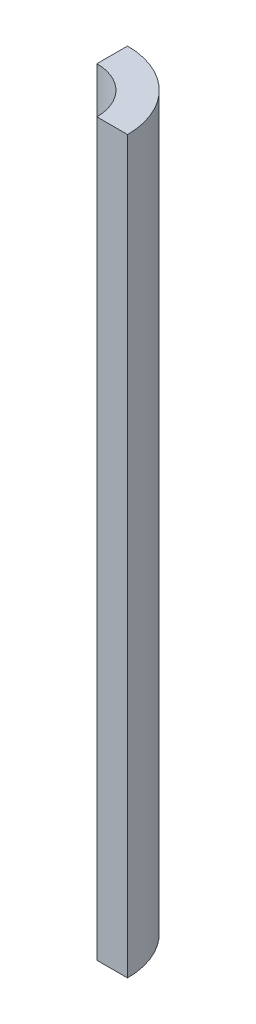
ISO-10303-21;
HEADER;
FILE_DESCRIPTION(('STEP AP214'),'2;1');
FILE_NAME('part.step','',(''),(''),'','','');
FILE_SCHEMA(('AUTOMOTIVE_DESIGN { 1 0 10303 214 1 1 1 1 }'));
ENDSEC;
DATA;
#1=APPLICATION_CONTEXT('core data for automotive mechanical design processes');
#2=APPLICATION_PROTOCOL_DEFINITION('international standard','automotive_design',2000,#1);
#3=PRODUCT_CONTEXT('',#1,'mechanical');
#4=PRODUCT('Part','Part','',(#3));
#5=PRODUCT_RELATED_PRODUCT_CATEGORY('part','',(#4));
#6=PRODUCT_DEFINITION_FORMATION('','',#4);
#7=PRODUCT_DEFINITION_CONTEXT('part definition',#1,'design');
#8=PRODUCT_DEFINITION('design','',#6,#7);
#9=PRODUCT_DEFINITION_SHAPE('','',#8);
#10=(LENGTH_UNIT() NAMED_UNIT(*) SI_UNIT(.MILLI.,.METRE.));
#11=(NAMED_UNIT(*) PLANE_ANGLE_UNIT() SI_UNIT($,.RADIAN.));
#12=(NAMED_UNIT(*) SI_UNIT($,.STERADIAN.) SOLID_ANGLE_UNIT());
#13=UNCERTAINTY_MEASURE_WITH_UNIT(LENGTH_MEASURE(1.E-05),#10,'distance_accuracy_value','');
#14=(GEOMETRIC_REPRESENTATION_CONTEXT(3) GLOBAL_UNCERTAINTY_ASSIGNED_CONTEXT((#13)) GLOBAL_UNIT_ASSIGNED_CONTEXT((#10,
#11,#12)) REPRESENTATION_CONTEXT('',''));
#15=CARTESIAN_POINT('',(0.,0.,0.));
#16=DIRECTION('',(0.,0.,1.));
#17=DIRECTION('',(1.,0.,0.));
#18=AXIS2_PLACEMENT_3D('',#15,#16,#17);
#19=CARTESIAN_POINT('',(0.,47.625,0.));
#20=DIRECTION('',(0.,-1.,0.));
#21=DIRECTION('',(0.,0.,-1.));
#22=AXIS2_PLACEMENT_3D('',#19,#20,#21);
#23=CYLINDRICAL_SURFACE('',#22,5.);
#24=CARTESIAN_POINT('',(0.,0.,0.));
#25=DIRECTION('',(0.,1.,0.));
#26=DIRECTION('',(0.,0.,1.));
#27=AXIS2_PLACEMENT_3D('',#24,#25,#26);
#28=CIRCLE('',#27,5.);
#29=CARTESIAN_POINT('',(5.,0.,0.));
#30=VERTEX_POINT('',#29);
#31=CARTESIAN_POINT('',(0.,0.,-5.));
#32=VERTEX_POINT('',#31);
#33=EDGE_CURVE('E113',#30,#32,#28,.T.);
#34=ORIENTED_EDGE('',*,*,#33,.T.);
#35=DIRECTION('',(0.,-1.,0.));
#36=VECTOR('',#35,1.);
#37=CARTESIAN_POINT('',(0.,47.625,-5.));
#38=LINE('',#37,#36);
#39=CARTESIAN_POINT('',(0.,47.625,-5.));
#40=VERTEX_POINT('',#39);
#41=EDGE_CURVE('E11',#40,#32,#38,.T.);
#42=ORIENTED_EDGE('',*,*,#41,.F.);
#43=CARTESIAN_POINT('',(0.,47.625,0.));
#44=DIRECTION('',(0.,1.,0.));
#45=DIRECTION('',(0.,0.,1.));
#46=AXIS2_PLACEMENT_3D('',#43,#44,#45);
#47=CIRCLE('',#46,5.);
#48=CARTESIAN_POINT('',(5.,47.625,0.));
#49=VERTEX_POINT('',#48);
#50=EDGE_CURVE('E97',#49,#40,#47,.T.);
#51=ORIENTED_EDGE('',*,*,#50,.F.);
#52=DIRECTION('',(0.,-1.,0.));
#53=VECTOR('',#52,1.);
#54=CARTESIAN_POINT('',(5.,47.625,0.));
#55=LINE('',#54,#53);
#56=EDGE_CURVE('E109',#49,#30,#55,.T.);
#57=ORIENTED_EDGE('',*,*,#56,.T.);
#58=EDGE_LOOP('',(#34,#42,#51,#57));
#59=FACE_BOUND('',#58,.T.);
#60=ADVANCED_FACE('F45',(#59),#23,.T.);
#61=CARTESIAN_POINT('',(0.,47.625,-3.00000000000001));
#62=DIRECTION('',(1.,0.,0.));
#63=DIRECTION('',(0.,0.,-1.));
#64=AXIS2_PLACEMENT_3D('',#61,#62,#63);
#65=PLANE('',#64);
#66=DIRECTION('',(0.,0.,1.));
#67=VECTOR('',#66,1.);
#68=CARTESIAN_POINT('',(0.,0.,-3.00000000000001));
#69=LINE('',#68,#67);
#70=CARTESIAN_POINT('',(0.,0.,-3.00000000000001));
#71=VERTEX_POINT('',#70);
#72=EDGE_CURVE('E102',#32,#71,#69,.T.);
#73=ORIENTED_EDGE('',*,*,#72,.T.);
#74=DIRECTION('',(0.,-1.,0.));
#75=VECTOR('',#74,1.);
#76=CARTESIAN_POINT('',(0.,47.625,-3.00000000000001));
#77=LINE('',#76,#75);
#78=CARTESIAN_POINT('',(0.,47.625,-3.00000000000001));
#79=VERTEX_POINT('',#78);
#80=EDGE_CURVE('E54',#79,#71,#77,.T.);
#81=ORIENTED_EDGE('',*,*,#80,.F.);
#82=DIRECTION('',(0.,0.,1.));
#83=VECTOR('',#82,1.);
#84=CARTESIAN_POINT('',(0.,47.625,-3.00000000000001));
#85=LINE('',#84,#83);
#86=EDGE_CURVE('E92',#40,#79,#85,.T.);
#87=ORIENTED_EDGE('',*,*,#86,.F.);
#88=ORIENTED_EDGE('',*,*,#41,.T.);
#89=EDGE_LOOP('',(#73,#81,#87,#88));
#90=FACE_BOUND('',#89,.T.);
#91=ADVANCED_FACE('F101',(#90),#65,.F.);
#92=CARTESIAN_POINT('',(0.,47.625,0.));
#93=DIRECTION('',(0.,-1.,0.));
#94=DIRECTION('',(0.,0.,-1.));
#95=AXIS2_PLACEMENT_3D('',#92,#93,#94);
#96=CYLINDRICAL_SURFACE('',#95,3.00000000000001);
#97=CARTESIAN_POINT('',(0.,0.,0.));
#98=DIRECTION('',(0.,-1.,0.));
#99=DIRECTION('',(0.,0.,1.));
#100=AXIS2_PLACEMENT_3D('',#97,#98,#99);
#101=CIRCLE('',#100,3.00000000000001);
#102=CARTESIAN_POINT('',(3.00000000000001,0.,0.));
#103=VERTEX_POINT('',#102);
#104=EDGE_CURVE('E79',#71,#103,#101,.T.);
#105=ORIENTED_EDGE('',*,*,#104,.T.);
#106=DIRECTION('',(0.,-1.,0.));
#107=VECTOR('',#106,1.);
#108=CARTESIAN_POINT('',(3.00000000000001,47.625,0.));
#109=LINE('',#108,#107);
#110=CARTESIAN_POINT('',(3.00000000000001,47.625,0.));
#111=VERTEX_POINT('',#110);
#112=EDGE_CURVE('E104',#111,#103,#109,.T.);
#113=ORIENTED_EDGE('',*,*,#112,.F.);
#114=CARTESIAN_POINT('',(0.,47.625,0.));
#115=DIRECTION('',(0.,-1.,0.));
#116=DIRECTION('',(0.,0.,1.));
#117=AXIS2_PLACEMENT_3D('',#114,#115,#116);
#118=CIRCLE('',#117,3.00000000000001);
#119=EDGE_CURVE('E95',#79,#111,#118,.T.);
#120=ORIENTED_EDGE('',*,*,#119,.F.);
#121=ORIENTED_EDGE('',*,*,#80,.T.);
#122=EDGE_LOOP('',(#105,#113,#120,#121));
#123=FACE_BOUND('',#122,.T.);
#124=ADVANCED_FACE('F105',(#123),#96,.F.);
#125=CARTESIAN_POINT('',(3.00000000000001,47.625,0.));
#126=DIRECTION('',(0.,0.,-1.));
#127=DIRECTION('',(-1.,0.,0.));
#128=AXIS2_PLACEMENT_3D('',#125,#126,#127);
#129=PLANE('',#128);
#130=DIRECTION('',(1.,0.,0.));
#131=VECTOR('',#130,1.);
#132=CARTESIAN_POINT('',(3.00000000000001,0.,0.));
#133=LINE('',#132,#131);
#134=EDGE_CURVE('E85',#103,#30,#133,.T.);
#135=ORIENTED_EDGE('',*,*,#134,.T.);
#136=ORIENTED_EDGE('',*,*,#56,.F.);
#137=DIRECTION('',(1.,0.,0.));
#138=VECTOR('',#137,1.);
#139=CARTESIAN_POINT('',(3.00000000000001,47.625,0.));
#140=LINE('',#139,#138);
#141=EDGE_CURVE('E62',#111,#49,#140,.T.);
#142=ORIENTED_EDGE('',*,*,#141,.F.);
#143=ORIENTED_EDGE('',*,*,#112,.T.);
#144=EDGE_LOOP('',(#135,#136,#142,#143));
#145=FACE_BOUND('',#144,.T.);
#146=ADVANCED_FACE('F126',(#145),#129,.F.);
#147=CARTESIAN_POINT('',(0.,47.625,0.));
#148=DIRECTION('',(0.,1.,0.));
#149=DIRECTION('',(0.,0.,1.));
#150=AXIS2_PLACEMENT_3D('',#147,#148,#149);
#151=PLANE('',#150);
#152=ORIENTED_EDGE('',*,*,#50,.T.);
#153=ORIENTED_EDGE('',*,*,#86,.T.);
#154=ORIENTED_EDGE('',*,*,#119,.T.);
#155=ORIENTED_EDGE('',*,*,#141,.T.);
#156=EDGE_LOOP('',(#152,#153,#154,#155));
#157=FACE_BOUND('',#156,.T.);
#158=ADVANCED_FACE('F93',(#157),#151,.T.);
#159=CARTESIAN_POINT('',(0.,0.,0.));
#160=DIRECTION('',(0.,1.,0.));
#161=DIRECTION('',(0.,0.,1.));
#162=AXIS2_PLACEMENT_3D('',#159,#160,#161);
#163=PLANE('',#162);
#164=ORIENTED_EDGE('',*,*,#33,.F.);
#165=ORIENTED_EDGE('',*,*,#134,.F.);
#166=ORIENTED_EDGE('',*,*,#104,.F.);
#167=ORIENTED_EDGE('',*,*,#72,.F.);
#168=EDGE_LOOP('',(#164,#165,#166,#167));
#169=FACE_BOUND('',#168,.T.);
#170=ADVANCED_FACE('F129',(#169),#163,.F.);
#171=CLOSED_SHELL('',(#60,#91,#124,#146,#158,#170));
#172=MANIFOLD_SOLID_BREP('B2',#171);
#173=ADVANCED_BREP_SHAPE_REPRESENTATION('',(#18,#172),#14);
#174=SHAPE_DEFINITION_REPRESENTATION(#9,#173);
ENDSEC;
END-ISO-10303-21;
